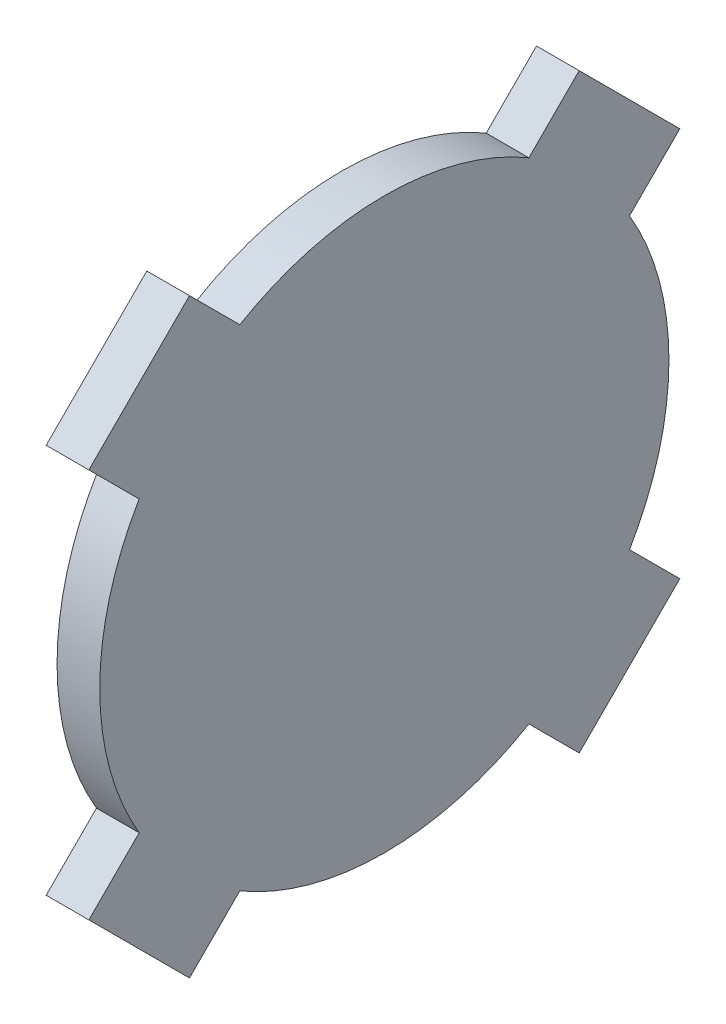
from build123d import *

# Parameters (mm, degrees)
BOSS_EXTRUDE1_DEPTH = 3


with BuildPart() as part:
    # Sketch1 → Boss-Extrude1 (new body)
    with BuildSketch(Plane(origin=(0, 0, 0), x_dir=(0, 0, -1), z_dir=(1, 0, 0))):
        with BuildLine():
            Line((71.952462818, -30.537269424), (64.881395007, -37.608337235))
            Line((64.881395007, -37.608337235), (61.345861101, -34.07280333))
            ThreePointArc((61.345861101, -34.07280333), (51.188331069, -36.844205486), (41.030801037, -34.07280333))
            Line((41.030801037, -34.07280333), (37.495267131, -37.608337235))
            Line((37.495267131, -37.608337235), (30.424199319, -30.537269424))
            Line((30.424199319, -30.537269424), (33.959733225, -27.001735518))
            ThreePointArc((33.959733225, -27.001735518), (31.188331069, -16.844205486), (33.959733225, -6.686675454))
            Line((33.959733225, -6.686675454), (30.424199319, -3.151141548))
            Line((30.424199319, -3.151141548), (37.495267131, 3.919926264))
            Line((37.495267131, 3.919926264), (41.030801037, 0.384392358))
            ThreePointArc((41.030801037, 0.384392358), (51.188331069, 3.155794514), (61.345861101, 0.384392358))
            Line((61.345861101, 0.384392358), (64.881395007, 3.919926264))
            Line((64.881395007, 3.919926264), (71.952462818, -3.151141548))
            Line((71.952462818, -3.151141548), (68.416928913, -6.686675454))
            ThreePointArc((68.416928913, -6.686675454), (71.188331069, -16.844205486), (68.416928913, -27.001735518))
            Line((68.416928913, -27.001735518), (71.952462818, -30.537269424))
        make_face()
    extrude(amount=BOSS_EXTRUDE1_DEPTH)


solid = part.part
